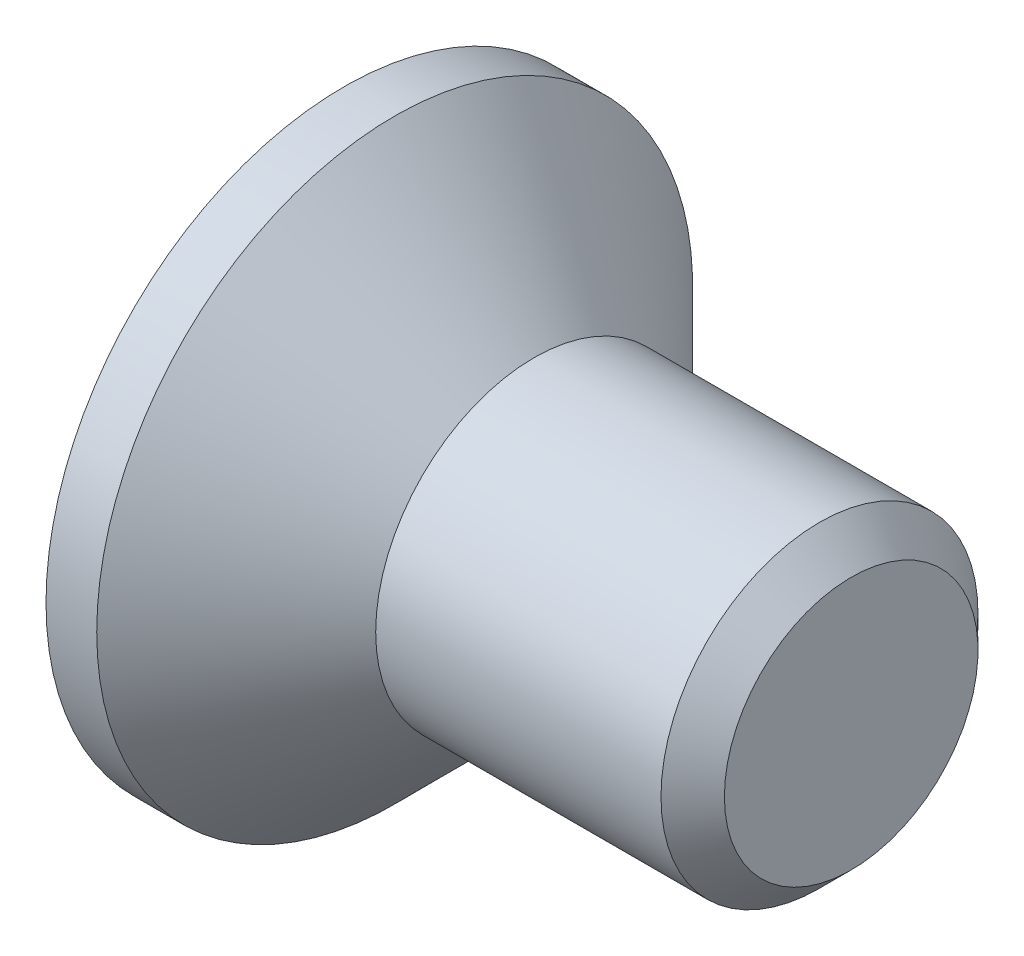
from build123d import *

# Parameters (mm, degrees)
CHAMFER1_SIZE      = 0.25
CUT_EXTRUDE1_DEPTH = 1.25


with BuildPart() as part:
    # Sketch1 → Revolve1 (revolve)
    with BuildSketch(Plane.XY, mode=Mode.PRIVATE) as revolve1_sk:
        Polygon((-1.5, 2.35), (-1.5, 0), (2.5, 0), (2.5, 1.25), (0, 1.25), (-1.1, 2.35), align=None)
    revolve(revolve1_sk.sketch.rotate(Axis((-1.5, 0, 0), (1, 0, 0)), 90), axis=Axis((-1.5, 0, 0), (1, 0, 0)))

    # Chamfer1
    chamfer1_edges = [part.edges().sort_by_distance(p)[0] for p in [
        (2.5, 0, -1.25),
    ]]
    chamfer(chamfer1_edges, length=CHAMFER1_SIZE)

    # Sketch2 → Cut-Extrude1 (cut)
    with BuildSketch(Plane.ZY.offset(1.5)):
        Polygon((-0.34, 1.35), (0.34, 1.35), (0.34, 0.34), (1.35, 0.34), (1.35, -0.34), (0.34, -0.34), (0.34, -1.35), (-0.34, -1.35), (-0.34, -0.34), (-1.35, -0.34), (-1.35, 0.34), (-0.34, 0.34), align=None)
    extrude(amount=-CUT_EXTRUDE1_DEPTH, mode=Mode.SUBTRACT)


solid = part.part
